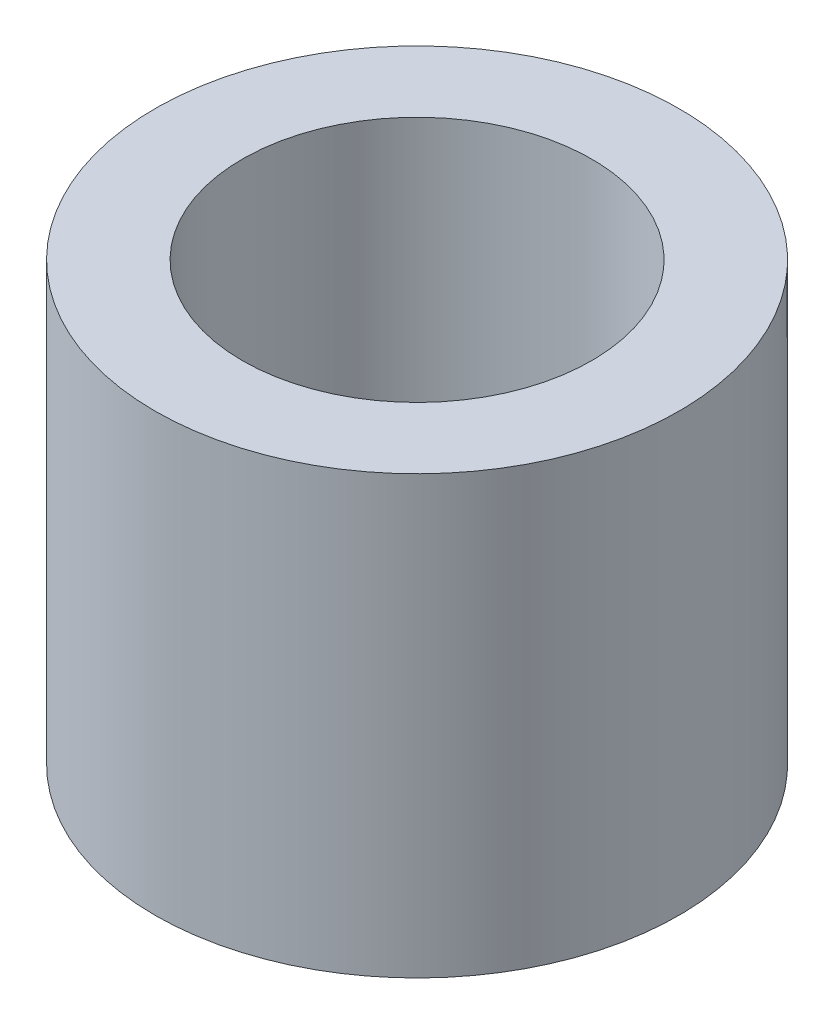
from build123d import *

# Parameters (mm, degrees)
SKETCH_1_R      = 1.5
SKETCH_1_R_2    = 1
EXTRUDE_1_DEPTH = 2.5


with BuildPart() as part:
    # Sketch 1 → Extrude 1 (new body)
    with BuildSketch(Plane(origin=(0, 0, 0), x_dir=(1, 0, 0), z_dir=(0, 1, 0))):
        with Locations(Location((0, 0, 0), (0, 0, 270))):
            Circle(SKETCH_1_R)
        with Locations(Location((0, 0, 0), (0, 0, 270))):
            Circle(SKETCH_1_R_2, mode=Mode.SUBTRACT)
    extrude(amount=EXTRUDE_1_DEPTH)


solid = part.part
